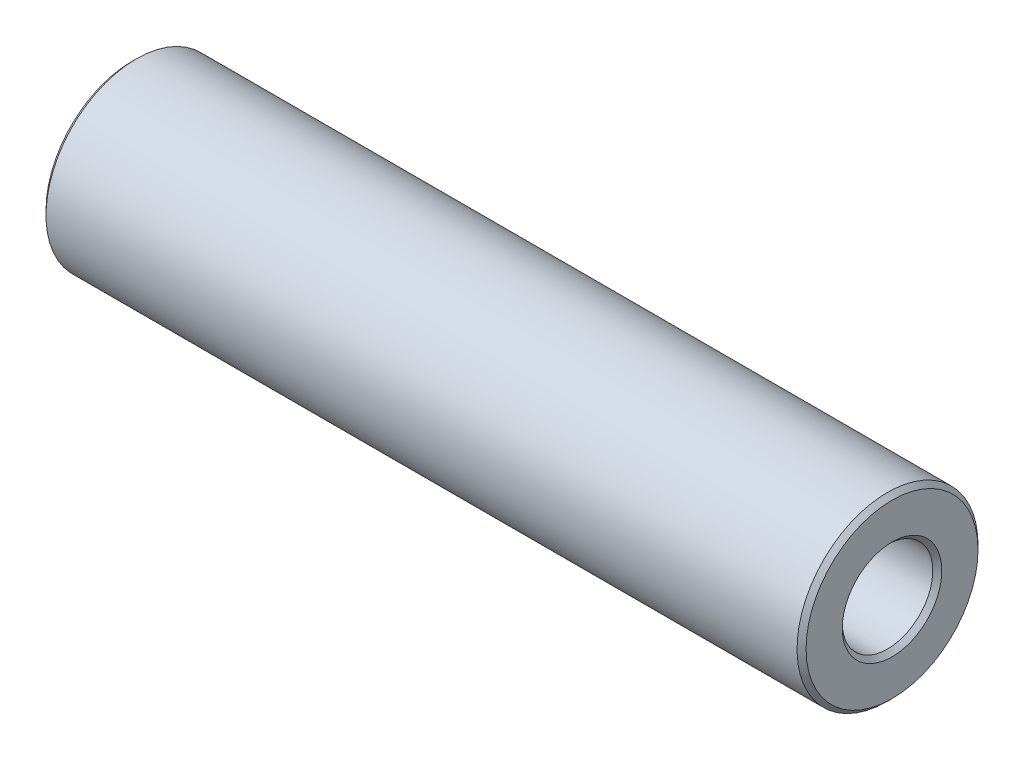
from build123d import *

# Parameters (mm, degrees)
ESQUISSE1_R        = 10
ESQUISSE1_R_2      = 5
BOSS_EXTRU_1_DEPTH = 84
CHANFREIN1_SIZE    = 0.5


with BuildPart() as part:
    # Esquisse1 → Boss.-Extru.1 (new body)
    with BuildSketch(Plane(origin=(25, 0, 0), x_dir=(0, 0, -1), z_dir=(1, 0, 0))):
        with Locations(Location((0, 0, 0), (0, 0, 180))):
            Circle(ESQUISSE1_R)
        with Locations(Location((0, 0, 0), (0, 0, 180))):
            Circle(ESQUISSE1_R_2, mode=Mode.SUBTRACT)
    extrude(amount=BOSS_EXTRU_1_DEPTH)

    # Chanfrein1
    chanfrein1_edges = [part.edges().sort_by_distance(p)[0] for p in [
        (25, 0, -10),
        (109, 0, -5),
        (25, 0, -5),
        (109, 0, -10),
    ]]
    chamfer(chanfrein1_edges, length=CHANFREIN1_SIZE)


solid = part.part
